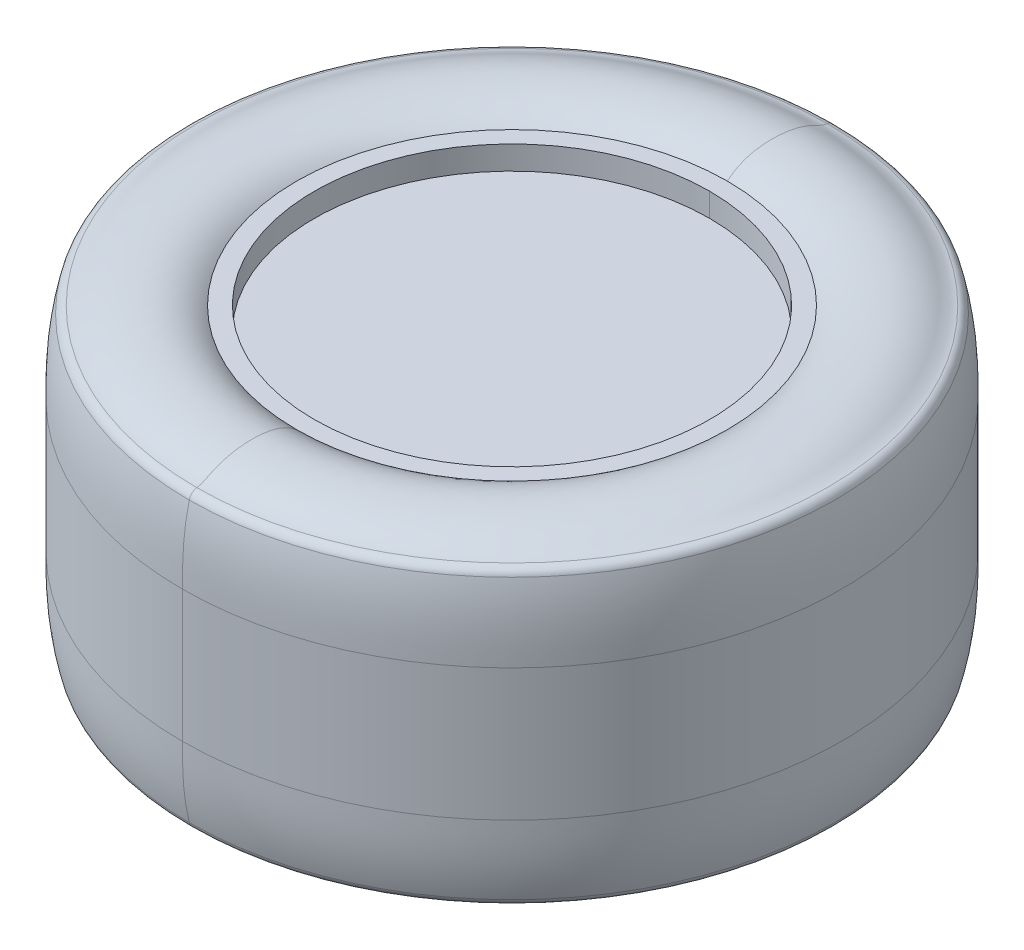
ISO-10303-21;
HEADER;
FILE_DESCRIPTION(('STEP AP214'),'2;1');
FILE_NAME('part.step','',(''),(''),'','','');
FILE_SCHEMA(('AUTOMOTIVE_DESIGN { 1 0 10303 214 1 1 1 1 }'));
ENDSEC;
DATA;
#1=APPLICATION_CONTEXT('core data for automotive mechanical design processes');
#2=APPLICATION_PROTOCOL_DEFINITION('international standard','automotive_design',2000,#1);
#3=PRODUCT_CONTEXT('',#1,'mechanical');
#4=PRODUCT('Part','Part','',(#3));
#5=PRODUCT_RELATED_PRODUCT_CATEGORY('part','',(#4));
#6=PRODUCT_DEFINITION_FORMATION('','',#4);
#7=PRODUCT_DEFINITION_CONTEXT('part definition',#1,'design');
#8=PRODUCT_DEFINITION('design','',#6,#7);
#9=PRODUCT_DEFINITION_SHAPE('','',#8);
#10=(LENGTH_UNIT() NAMED_UNIT(*) SI_UNIT(.MILLI.,.METRE.));
#11=(NAMED_UNIT(*) PLANE_ANGLE_UNIT() SI_UNIT($,.RADIAN.));
#12=(NAMED_UNIT(*) SI_UNIT($,.STERADIAN.) SOLID_ANGLE_UNIT());
#13=UNCERTAINTY_MEASURE_WITH_UNIT(LENGTH_MEASURE(1.E-05),#10,'distance_accuracy_value','');
#14=(GEOMETRIC_REPRESENTATION_CONTEXT(3) GLOBAL_UNCERTAINTY_ASSIGNED_CONTEXT((#13)) GLOBAL_UNIT_ASSIGNED_CONTEXT((#10,
#11,#12)) REPRESENTATION_CONTEXT('',''));
#15=CARTESIAN_POINT('',(0.,0.,0.));
#16=DIRECTION('',(0.,0.,1.));
#17=DIRECTION('',(1.,0.,0.));
#18=AXIS2_PLACEMENT_3D('',#15,#16,#17);
#19=CARTESIAN_POINT('',(3000.,-678.9999999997,71.320372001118));
#20=CARTESIAN_POINT('',(3000.,-668.463984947,58.611324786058));
#21=CARTESIAN_POINT('',(3000.,-661.736889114,36.802176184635));
#22=CARTESIAN_POINT('',(3000.,-661.4900912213,10.766149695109));
#23=CARTESIAN_POINT('',(3000.,-666.2308892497,-8.378636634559));
#24=CARTESIAN_POINT('',(3000.,-671.9334367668,-17.87878802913));
#25=CARTESIAN_POINT('',(3000.,-675.9960068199,-23.94984631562));
#26=CARTESIAN_POINT('',(3000.,-678.3635739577,-29.67599466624));
#27=CARTESIAN_POINT('',(3000.,-679.2386406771,-34.76891355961));
#28=(BOUNDED_CURVE() B_SPLINE_CURVE(7,(#19,#20,#21,#22,#23,#24,#25,#26,#27),.UNSPECIFIED.,.F.,
.F.) B_SPLINE_CURVE_WITH_KNOTS((8,1,8),(0.,0.532659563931,1.),
.UNSPECIFIED.) CURVE() GEOMETRIC_REPRESENTATION_ITEM() RATIONAL_B_SPLINE_CURVE((1.,1.,1.,1.,1.,
1.,1.,1.,1.)) REPRESENTATION_ITEM(''));
#29=CARTESIAN_POINT('',(3000.,-678.9999999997,300.));
#30=DIRECTION('',(0.,-1.,0.));
#31=AXIS1_PLACEMENT('',#29,#30);
#32=SURFACE_OF_REVOLUTION('',#28,#31);
#33=CARTESIAN_POINT('',(3000.,-678.9999999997,71.320372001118));
#34=CARTESIAN_POINT('',(3000.,-668.463984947,58.611324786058));
#35=CARTESIAN_POINT('',(3000.,-661.736889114,36.802176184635));
#36=CARTESIAN_POINT('',(3000.,-661.4900912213,10.766149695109));
#37=CARTESIAN_POINT('',(3000.,-666.2308892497,-8.37863663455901));
#38=CARTESIAN_POINT('',(3000.,-671.9334367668,-17.87878802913));
#39=CARTESIAN_POINT('',(3000.,-675.9960068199,-23.94984631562));
#40=CARTESIAN_POINT('',(3000.,-678.3635739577,-29.67599466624));
#41=CARTESIAN_POINT('',(3000.,-679.2386406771,-34.76891355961));
#42=(BOUNDED_CURVE() B_SPLINE_CURVE(7,(#33,#34,#35,#36,#37,#38,#39,#40,#41),.UNSPECIFIED.,.F.,
.F.) B_SPLINE_CURVE_WITH_KNOTS((8,1,8),(0.,0.532659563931,1.),
.UNSPECIFIED.) CURVE() GEOMETRIC_REPRESENTATION_ITEM() RATIONAL_B_SPLINE_CURVE((1.,1.,1.,1.,1.,
1.,1.,1.,1.)) REPRESENTATION_ITEM(''));
#43=CARTESIAN_POINT('',(3000.,-678.9999999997,71.32037200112));
#44=VERTEX_POINT('',#43);
#45=CARTESIAN_POINT('',(3000.,-679.2386406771,-34.76891355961));
#46=VERTEX_POINT('',#45);
#47=EDGE_CURVE('E206',#44,#46,#42,.T.);
#48=ORIENTED_EDGE('',*,*,#47,.F.);
#49=CARTESIAN_POINT('',(3000.,-678.9999999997,300.));
#50=DIRECTION('',(0.,1.,0.));
#51=DIRECTION('',(0.,0.,-1.));
#52=AXIS2_PLACEMENT_3D('',#49,#50,#51);
#53=CIRCLE('',#52,228.67962799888);
#54=CARTESIAN_POINT('',(3000.,-678.9999999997,528.679627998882));
#55=VERTEX_POINT('',#54);
#56=EDGE_CURVE('E41',#55,#44,#53,.T.);
#57=ORIENTED_EDGE('',*,*,#56,.F.);
#58=CARTESIAN_POINT('',(3000.,-678.9999999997,528.679627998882));
#59=CARTESIAN_POINT('',(3000.,-668.463984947,541.388675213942));
#60=CARTESIAN_POINT('',(3000.,-661.736889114,563.197823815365));
#61=CARTESIAN_POINT('',(3000.,-661.4900912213,589.233850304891));
#62=CARTESIAN_POINT('',(3000.,-666.2308892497,608.378636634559));
#63=CARTESIAN_POINT('',(3000.,-671.9334367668,617.87878802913));
#64=CARTESIAN_POINT('',(3000.,-675.9960068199,623.94984631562));
#65=CARTESIAN_POINT('',(3000.,-678.3635739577,629.67599466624));
#66=CARTESIAN_POINT('',(3000.,-679.2386406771,634.76891355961));
#67=(BOUNDED_CURVE() B_SPLINE_CURVE(7,(#58,#59,#60,#61,#62,#63,#64,#65,#66),.UNSPECIFIED.,.F.,
.F.) B_SPLINE_CURVE_WITH_KNOTS((8,1,8),(0.,0.532659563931,1.),
.UNSPECIFIED.) CURVE() GEOMETRIC_REPRESENTATION_ITEM() RATIONAL_B_SPLINE_CURVE((1.,1.,1.,1.,1.,
1.,1.,1.,1.)) REPRESENTATION_ITEM(''));
#68=CARTESIAN_POINT('',(3000.,-679.2386406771,634.76891355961));
#69=VERTEX_POINT('',#68);
#70=EDGE_CURVE('E11',#55,#69,#67,.T.);
#71=ORIENTED_EDGE('',*,*,#70,.T.);
#72=CARTESIAN_POINT('',(3000.,-679.2386406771,300.));
#73=DIRECTION('',(0.,1.,0.));
#74=DIRECTION('',(0.,0.,-1.));
#75=AXIS2_PLACEMENT_3D('',#72,#73,#74);
#76=CIRCLE('',#75,334.76891355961);
#77=EDGE_CURVE('E29',#69,#46,#76,.T.);
#78=ORIENTED_EDGE('',*,*,#77,.T.);
#79=EDGE_LOOP('',(#48,#57,#71,#78));
#80=FACE_BOUND('',#79,.T.);
#81=ADVANCED_FACE('F16',(#80),#32,.T.);
#82=CARTESIAN_POINT('',(3000.,-686.7224839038,-42.79019819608));
#83=CARTESIAN_POINT('',(3000.,-716.2539641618,-50.));
#84=CARTESIAN_POINT('',(3000.,-740.6190547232,-50.));
#85=CARTESIAN_POINT('',(3000.,-765.,-50.));
#86=(BOUNDED_CURVE() B_SPLINE_CURVE(3,(#82,#83,#84,#85),.UNSPECIFIED.,.F.,
.F.) B_SPLINE_CURVE_WITH_KNOTS((4,4),(0.,1.),
.UNSPECIFIED.) CURVE() GEOMETRIC_REPRESENTATION_ITEM() RATIONAL_B_SPLINE_CURVE((1.,1.,1.,1.)) REPRESENTATION_ITEM(''));
#87=CARTESIAN_POINT('',(3000.,-686.7224839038,300.));
#88=DIRECTION('',(0.,-1.,0.));
#89=AXIS1_PLACEMENT('',#87,#88);
#90=SURFACE_OF_REVOLUTION('',#86,#89);
#91=CARTESIAN_POINT('',(3000.,-686.7224839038,-42.79019819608));
#92=CARTESIAN_POINT('',(3000.,-716.2539641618,-50.));
#93=CARTESIAN_POINT('',(3000.,-740.6190547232,-50.));
#94=CARTESIAN_POINT('',(3000.,-765.,-50.));
#95=(BOUNDED_CURVE() B_SPLINE_CURVE(3,(#91,#92,#93,#94),.UNSPECIFIED.,.F.,
.F.) B_SPLINE_CURVE_WITH_KNOTS((4,4),(0.,1.),
.UNSPECIFIED.) CURVE() GEOMETRIC_REPRESENTATION_ITEM() RATIONAL_B_SPLINE_CURVE((1.,1.,1.,1.)) REPRESENTATION_ITEM(''));
#96=CARTESIAN_POINT('',(3000.,-686.722483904,-42.79019819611));
#97=VERTEX_POINT('',#96);
#98=CARTESIAN_POINT('',(3000.,-765.,-50.));
#99=VERTEX_POINT('',#98);
#100=EDGE_CURVE('E216',#97,#99,#95,.T.);
#101=ORIENTED_EDGE('',*,*,#100,.F.);
#102=CARTESIAN_POINT('',(3000.,-686.722483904,300.));
#103=DIRECTION('',(0.,1.,0.));
#104=DIRECTION('',(0.,0.,-1.));
#105=AXIS2_PLACEMENT_3D('',#102,#103,#104);
#106=CIRCLE('',#105,342.79019819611);
#107=CARTESIAN_POINT('',(3000.,-686.722483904,642.79019819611));
#108=VERTEX_POINT('',#107);
#109=EDGE_CURVE('E188',#108,#97,#106,.T.);
#110=ORIENTED_EDGE('',*,*,#109,.F.);
#111=CARTESIAN_POINT('',(3000.,-686.7224839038,642.79019819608));
#112=CARTESIAN_POINT('',(3000.,-716.2539641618,650.));
#113=CARTESIAN_POINT('',(3000.,-740.6190547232,650.));
#114=CARTESIAN_POINT('',(3000.,-765.,650.));
#115=(BOUNDED_CURVE() B_SPLINE_CURVE(3,(#111,#112,#113,#114),.UNSPECIFIED.,.F.,
.F.) B_SPLINE_CURVE_WITH_KNOTS((4,4),(0.,1.),
.UNSPECIFIED.) CURVE() GEOMETRIC_REPRESENTATION_ITEM() RATIONAL_B_SPLINE_CURVE((1.,1.,1.,1.)) REPRESENTATION_ITEM(''));
#116=CARTESIAN_POINT('',(3000.,-765.,650.));
#117=VERTEX_POINT('',#116);
#118=EDGE_CURVE('E357',#108,#117,#115,.T.);
#119=ORIENTED_EDGE('',*,*,#118,.T.);
#120=CARTESIAN_POINT('',(3000.,-765.,300.));
#121=DIRECTION('',(0.,1.,0.));
#122=DIRECTION('',(0.,0.,-1.));
#123=AXIS2_PLACEMENT_3D('',#120,#121,#122);
#124=CIRCLE('',#123,350.);
#125=EDGE_CURVE('E183',#117,#99,#124,.T.);
#126=ORIENTED_EDGE('',*,*,#125,.T.);
#127=EDGE_LOOP('',(#101,#110,#119,#126));
#128=FACE_BOUND('',#127,.T.);
#129=ADVANCED_FACE('F282',(#128),#90,.T.);
#130=CARTESIAN_POINT('',(3000.,-991.0000000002,71.320372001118));
#131=CARTESIAN_POINT('',(3000.,-1001.536015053,58.611324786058));
#132=CARTESIAN_POINT('',(3000.,-1008.263110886,36.802176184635));
#133=CARTESIAN_POINT('',(3000.,-1008.509908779,10.766149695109));
#134=CARTESIAN_POINT('',(3000.,-1003.76911075,-8.378636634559));
#135=CARTESIAN_POINT('',(3000.,-998.0665632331,-17.87878802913));
#136=CARTESIAN_POINT('',(3000.,-994.00399318,-23.94984631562));
#137=CARTESIAN_POINT('',(3000.,-991.6364260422,-29.67599466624));
#138=CARTESIAN_POINT('',(3000.,-990.7613593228,-34.76891355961));
#139=(BOUNDED_CURVE() B_SPLINE_CURVE(7,(#130,#131,#132,#133,#134,#135,#136,#137,#138),
.UNSPECIFIED.,.F.,.F.) B_SPLINE_CURVE_WITH_KNOTS((8,1,8),(0.,0.532659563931,1.),
.UNSPECIFIED.) CURVE() GEOMETRIC_REPRESENTATION_ITEM() RATIONAL_B_SPLINE_CURVE((1.,1.,1.,1.,1.,
1.,1.,1.,1.)) REPRESENTATION_ITEM(''));
#140=CARTESIAN_POINT('',(3000.,-991.0000000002,300.));
#141=DIRECTION('',(0.,1.,0.));
#142=AXIS1_PLACEMENT('',#140,#141);
#143=SURFACE_OF_REVOLUTION('',#139,#142);
#144=CARTESIAN_POINT('',(3000.,-991.0000000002,71.320372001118));
#145=CARTESIAN_POINT('',(3000.,-1001.536015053,58.611324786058));
#146=CARTESIAN_POINT('',(3000.,-1008.263110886,36.802176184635));
#147=CARTESIAN_POINT('',(3000.,-1008.509908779,10.766149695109));
#148=CARTESIAN_POINT('',(3000.,-1003.76911075,-8.37863663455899));
#149=CARTESIAN_POINT('',(3000.,-998.0665632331,-17.87878802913));
#150=CARTESIAN_POINT('',(3000.,-994.00399318,-23.94984631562));
#151=CARTESIAN_POINT('',(3000.,-991.6364260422,-29.67599466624));
#152=CARTESIAN_POINT('',(3000.,-990.7613593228,-34.76891355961));
#153=(BOUNDED_CURVE() B_SPLINE_CURVE(7,(#144,#145,#146,#147,#148,#149,#150,#151,#152),
.UNSPECIFIED.,.F.,.F.) B_SPLINE_CURVE_WITH_KNOTS((8,1,8),(0.,0.532659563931,1.),
.UNSPECIFIED.) CURVE() GEOMETRIC_REPRESENTATION_ITEM() RATIONAL_B_SPLINE_CURVE((1.,1.,1.,1.,1.,
1.,1.,1.,1.)) REPRESENTATION_ITEM(''));
#154=CARTESIAN_POINT('',(3000.,-991.0000000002,71.32037200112));
#155=VERTEX_POINT('',#154);
#156=CARTESIAN_POINT('',(3000.,-990.7613593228,-34.76891355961));
#157=VERTEX_POINT('',#156);
#158=EDGE_CURVE('E389',#155,#157,#153,.T.);
#159=ORIENTED_EDGE('',*,*,#158,.F.);
#160=CARTESIAN_POINT('',(3000.,-991.0000000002,300.));
#161=DIRECTION('',(0.,-1.,0.));
#162=DIRECTION('',(0.,0.,-1.));
#163=AXIS2_PLACEMENT_3D('',#160,#161,#162);
#164=CIRCLE('',#163,228.67962799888);
#165=CARTESIAN_POINT('',(3000.,-991.0000000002,528.679627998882));
#166=VERTEX_POINT('',#165);
#167=EDGE_CURVE('E395',#166,#155,#164,.T.);
#168=ORIENTED_EDGE('',*,*,#167,.F.);
#169=CARTESIAN_POINT('',(3000.,-991.0000000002,528.679627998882));
#170=CARTESIAN_POINT('',(3000.,-1001.536015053,541.388675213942));
#171=CARTESIAN_POINT('',(3000.,-1008.263110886,563.197823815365));
#172=CARTESIAN_POINT('',(3000.,-1008.509908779,589.233850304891));
#173=CARTESIAN_POINT('',(3000.,-1003.76911075,608.378636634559));
#174=CARTESIAN_POINT('',(3000.,-998.0665632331,617.87878802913));
#175=CARTESIAN_POINT('',(3000.,-994.00399318,623.94984631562));
#176=CARTESIAN_POINT('',(3000.,-991.6364260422,629.67599466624));
#177=CARTESIAN_POINT('',(3000.,-990.7613593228,634.76891355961));
#178=(BOUNDED_CURVE() B_SPLINE_CURVE(7,(#169,#170,#171,#172,#173,#174,#175,#176,#177),
.UNSPECIFIED.,.F.,.F.) B_SPLINE_CURVE_WITH_KNOTS((8,1,8),(0.,0.532659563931,1.),
.UNSPECIFIED.) CURVE() GEOMETRIC_REPRESENTATION_ITEM() RATIONAL_B_SPLINE_CURVE((1.,1.,1.,1.,1.,
1.,1.,1.,1.)) REPRESENTATION_ITEM(''));
#179=CARTESIAN_POINT('',(3000.,-990.7613593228,634.76891355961));
#180=VERTEX_POINT('',#179);
#181=EDGE_CURVE('E231',#166,#180,#178,.T.);
#182=ORIENTED_EDGE('',*,*,#181,.T.);
#183=CARTESIAN_POINT('',(3000.,-990.7613593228,300.));
#184=DIRECTION('',(0.,-1.,0.));
#185=DIRECTION('',(0.,0.,-1.));
#186=AXIS2_PLACEMENT_3D('',#183,#184,#185);
#187=CIRCLE('',#186,334.76891355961);
#188=EDGE_CURVE('E224',#180,#157,#187,.T.);
#189=ORIENTED_EDGE('',*,*,#188,.T.);
#190=EDGE_LOOP('',(#159,#168,#182,#189));
#191=FACE_BOUND('',#190,.T.);
#192=ADVANCED_FACE('F288',(#191),#143,.T.);
#193=CARTESIAN_POINT('',(3000.,-983.2775160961,-42.79019819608));
#194=CARTESIAN_POINT('',(3000.,-953.7460358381,-50.));
#195=CARTESIAN_POINT('',(3000.,-929.3809452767,-50.));
#196=CARTESIAN_POINT('',(3000.,-905.,-50.));
#197=(BOUNDED_CURVE() B_SPLINE_CURVE(3,(#193,#194,#195,#196),.UNSPECIFIED.,.F.,
.F.) B_SPLINE_CURVE_WITH_KNOTS((4,4),(0.,1.),
.UNSPECIFIED.) CURVE() GEOMETRIC_REPRESENTATION_ITEM() RATIONAL_B_SPLINE_CURVE((1.,1.,1.,1.)) REPRESENTATION_ITEM(''));
#198=CARTESIAN_POINT('',(3000.,-983.2775160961,300.));
#199=DIRECTION('',(0.,1.,0.));
#200=AXIS1_PLACEMENT('',#198,#199);
#201=SURFACE_OF_REVOLUTION('',#197,#200);
#202=CARTESIAN_POINT('',(3000.,-983.2775160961,-42.79019819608));
#203=CARTESIAN_POINT('',(3000.,-953.7460358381,-50.));
#204=CARTESIAN_POINT('',(3000.,-929.3809452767,-50.));
#205=CARTESIAN_POINT('',(3000.,-905.,-50.));
#206=(BOUNDED_CURVE() B_SPLINE_CURVE(3,(#202,#203,#204,#205),.UNSPECIFIED.,.F.,
.F.) B_SPLINE_CURVE_WITH_KNOTS((4,4),(0.,1.),
.UNSPECIFIED.) CURVE() GEOMETRIC_REPRESENTATION_ITEM() RATIONAL_B_SPLINE_CURVE((1.,1.,1.,1.)) REPRESENTATION_ITEM(''));
#207=CARTESIAN_POINT('',(3000.,-983.2775160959,-42.79019819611));
#208=VERTEX_POINT('',#207);
#209=CARTESIAN_POINT('',(3000.,-905.,-50.));
#210=VERTEX_POINT('',#209);
#211=EDGE_CURVE('E193',#208,#210,#206,.T.);
#212=ORIENTED_EDGE('',*,*,#211,.F.);
#213=CARTESIAN_POINT('',(3000.,-983.2775160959,300.));
#214=DIRECTION('',(0.,-1.,0.));
#215=DIRECTION('',(0.,0.,-1.));
#216=AXIS2_PLACEMENT_3D('',#213,#214,#215);
#217=CIRCLE('',#216,342.79019819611);
#218=CARTESIAN_POINT('',(3000.,-983.2775160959,642.79019819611));
#219=VERTEX_POINT('',#218);
#220=EDGE_CURVE('E171',#219,#208,#217,.T.);
#221=ORIENTED_EDGE('',*,*,#220,.F.);
#222=CARTESIAN_POINT('',(3000.,-983.2775160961,642.79019819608));
#223=CARTESIAN_POINT('',(3000.,-953.7460358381,650.));
#224=CARTESIAN_POINT('',(3000.,-929.3809452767,650.));
#225=CARTESIAN_POINT('',(3000.,-905.,650.));
#226=(BOUNDED_CURVE() B_SPLINE_CURVE(3,(#222,#223,#224,#225),.UNSPECIFIED.,.F.,
.F.) B_SPLINE_CURVE_WITH_KNOTS((4,4),(0.,1.),
.UNSPECIFIED.) CURVE() GEOMETRIC_REPRESENTATION_ITEM() RATIONAL_B_SPLINE_CURVE((1.,1.,1.,1.)) REPRESENTATION_ITEM(''));
#227=CARTESIAN_POINT('',(3000.,-905.,650.));
#228=VERTEX_POINT('',#227);
#229=EDGE_CURVE('E232',#219,#228,#226,.T.);
#230=ORIENTED_EDGE('',*,*,#229,.T.);
#231=CARTESIAN_POINT('',(3000.,-905.,300.));
#232=DIRECTION('',(0.,-1.,0.));
#233=DIRECTION('',(0.,0.,-1.));
#234=AXIS2_PLACEMENT_3D('',#231,#232,#233);
#235=CIRCLE('',#234,350.);
#236=EDGE_CURVE('E236',#228,#210,#235,.T.);
#237=ORIENTED_EDGE('',*,*,#236,.T.);
#238=EDGE_LOOP('',(#212,#221,#230,#237));
#239=FACE_BOUND('',#238,.T.);
#240=ADVANCED_FACE('F292',(#239),#201,.T.);
#241=CARTESIAN_POINT('',(3000.,-743.6418141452,300.));
#242=DIRECTION('',(0.,-1.,0.));
#243=DIRECTION('',(0.,0.,1.));
#244=AXIS2_PLACEMENT_3D('',#241,#242,#243);
#245=CYLINDRICAL_SURFACE('',#244,210.);
#246=DIRECTION('',(0.,-1.,0.));
#247=VECTOR('',#246,1.);
#248=CARTESIAN_POINT('',(3000.,-691.49999999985,510.));
#249=LINE('',#248,#247);
#250=CARTESIAN_POINT('',(3000.,-678.9999999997,510.));
#251=VERTEX_POINT('',#250);
#252=CARTESIAN_POINT('',(3000.,-704.,510.));
#253=VERTEX_POINT('',#252);
#254=EDGE_CURVE('E149',#251,#253,#249,.T.);
#255=ORIENTED_EDGE('',*,*,#254,.F.);
#256=CARTESIAN_POINT('',(3000.,-678.9999999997,300.));
#257=DIRECTION('',(0.,1.,0.));
#258=DIRECTION('',(0.,0.,-1.));
#259=AXIS2_PLACEMENT_3D('',#256,#257,#258);
#260=CIRCLE('',#259,210.);
#261=CARTESIAN_POINT('',(3000.,-678.9999999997,90.));
#262=VERTEX_POINT('',#261);
#263=EDGE_CURVE('E233',#251,#262,#260,.T.);
#264=ORIENTED_EDGE('',*,*,#263,.T.);
#265=DIRECTION('',(0.,1.,0.));
#266=VECTOR('',#265,1.);
#267=CARTESIAN_POINT('',(3000.,-691.49999999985,90.));
#268=LINE('',#267,#266);
#269=CARTESIAN_POINT('',(3000.,-704.,90.));
#270=VERTEX_POINT('',#269);
#271=EDGE_CURVE('E160',#270,#262,#268,.T.);
#272=ORIENTED_EDGE('',*,*,#271,.F.);
#273=CARTESIAN_POINT('',(3000.,-704.,300.));
#274=DIRECTION('',(0.,1.,0.));
#275=DIRECTION('',(0.,0.,-1.));
#276=AXIS2_PLACEMENT_3D('',#273,#274,#275);
#277=CIRCLE('',#276,210.);
#278=EDGE_CURVE('E163',#253,#270,#277,.T.);
#279=ORIENTED_EDGE('',*,*,#278,.F.);
#280=EDGE_LOOP('',(#255,#264,#272,#279));
#281=FACE_BOUND('',#280,.T.);
#282=ADVANCED_FACE('F164',(#281),#245,.F.);
#283=CARTESIAN_POINT('',(3000.,-689.0942196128,300.));
#284=DIRECTION('',(0.,1.,0.));
#285=DIRECTION('',(0.,0.,1.));
#286=AXIS2_PLACEMENT_3D('',#283,#284,#285);
#287=TOROIDAL_SURFACE('',#286,333.07552528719,10.);
#288=CARTESIAN_POINT('',(3000.,-689.0942196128,633.07552528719));
#289=DIRECTION('',(-1.,0.,0.));
#290=DIRECTION('',(0.,0.,1.));
#291=AXIS2_PLACEMENT_3D('',#288,#289,#290);
#292=CIRCLE('',#291,10.);
#293=EDGE_CURVE('E240',#108,#69,#292,.T.);
#294=ORIENTED_EDGE('',*,*,#293,.F.);
#295=ORIENTED_EDGE('',*,*,#109,.T.);
#296=CARTESIAN_POINT('',(3000.,-689.0942196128,-33.07552528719));
#297=DIRECTION('',(-1.,0.,0.));
#298=DIRECTION('',(0.,0.,-1.));
#299=AXIS2_PLACEMENT_3D('',#296,#297,#298);
#300=CIRCLE('',#299,10.);
#301=EDGE_CURVE('E205',#46,#97,#300,.T.);
#302=ORIENTED_EDGE('',*,*,#301,.F.);
#303=ORIENTED_EDGE('',*,*,#77,.F.);
#304=EDGE_LOOP('',(#294,#295,#302,#303));
#305=FACE_BOUND('',#304,.T.);
#306=ADVANCED_FACE('F506',(#305),#287,.T.);
#307=CARTESIAN_POINT('',(3000.,-926.3581858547,300.));
#308=DIRECTION('',(0.,-1.,0.));
#309=DIRECTION('',(0.,0.,1.));
#310=AXIS2_PLACEMENT_3D('',#307,#308,#309);
#311=CONICAL_SURFACE('',#310,193.50933335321,0.872664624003);
#312=DIRECTION('',(0.,0.642787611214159,-0.766044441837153));
#313=VECTOR('',#312,1.);
#314=CARTESIAN_POINT('',(3000.,-926.3581858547,493.50933335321));
#315=LINE('',#314,#313);
#316=CARTESIAN_POINT('',(3000.,-936.,505.));
#317=VERTEX_POINT('',#316);
#318=CARTESIAN_POINT('',(3000.,-926.3581858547,493.50933335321));
#319=VERTEX_POINT('',#318);
#320=EDGE_CURVE('E211',#317,#319,#315,.T.);
#321=ORIENTED_EDGE('',*,*,#320,.F.);
#322=CARTESIAN_POINT('',(3000.,-936.,300.));
#323=DIRECTION('',(0.,-1.,0.));
#324=DIRECTION('',(0.,0.,-1.));
#325=AXIS2_PLACEMENT_3D('',#322,#323,#324);
#326=CIRCLE('',#325,205.);
#327=CARTESIAN_POINT('',(3000.,-936.,95.));
#328=VERTEX_POINT('',#327);
#329=EDGE_CURVE('E185',#317,#328,#326,.T.);
#330=ORIENTED_EDGE('',*,*,#329,.T.);
#331=DIRECTION('',(0.,-0.642787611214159,-0.766044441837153));
#332=VECTOR('',#331,1.);
#333=CARTESIAN_POINT('',(3000.,-926.3581858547,106.49066664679));
#334=LINE('',#333,#332);
#335=CARTESIAN_POINT('',(3000.,-926.3581858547,106.49066664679));
#336=VERTEX_POINT('',#335);
#337=EDGE_CURVE('E199',#336,#328,#334,.T.);
#338=ORIENTED_EDGE('',*,*,#337,.F.);
#339=CARTESIAN_POINT('',(3000.,-926.3581858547,300.));
#340=DIRECTION('',(0.,-1.,0.));
#341=DIRECTION('',(0.,0.,-1.));
#342=AXIS2_PLACEMENT_3D('',#339,#340,#341);
#343=CIRCLE('',#342,193.50933335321);
#344=EDGE_CURVE('E222',#319,#336,#343,.T.);
#345=ORIENTED_EDGE('',*,*,#344,.F.);
#346=EDGE_LOOP('',(#321,#330,#338,#345));
#347=FACE_BOUND('',#346,.T.);
#348=ADVANCED_FACE('F472',(#347),#311,.F.);
#349=CARTESIAN_POINT('',(3000.,-926.3581858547,300.));
#350=DIRECTION('',(0.,1.,0.));
#351=DIRECTION('',(0.,0.,1.));
#352=AXIS2_PLACEMENT_3D('',#349,#350,#351);
#353=CYLINDRICAL_SURFACE('',#352,210.);
#354=DIRECTION('',(0.,1.,0.));
#355=VECTOR('',#354,1.);
#356=CARTESIAN_POINT('',(3000.,-963.5000000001,510.));
#357=LINE('',#356,#355);
#358=CARTESIAN_POINT('',(3000.,-991.0000000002,510.));
#359=VERTEX_POINT('',#358);
#360=CARTESIAN_POINT('',(3000.,-936.,510.));
#361=VERTEX_POINT('',#360);
#362=EDGE_CURVE('E423',#359,#361,#357,.T.);
#363=ORIENTED_EDGE('',*,*,#362,.F.);
#364=CARTESIAN_POINT('',(3000.,-991.0000000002,300.));
#365=DIRECTION('',(0.,-1.,0.));
#366=DIRECTION('',(0.,0.,-1.));
#367=AXIS2_PLACEMENT_3D('',#364,#365,#366);
#368=CIRCLE('',#367,210.);
#369=CARTESIAN_POINT('',(3000.,-991.0000000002,90.));
#370=VERTEX_POINT('',#369);
#371=EDGE_CURVE('E179',#359,#370,#368,.T.);
#372=ORIENTED_EDGE('',*,*,#371,.T.);
#373=DIRECTION('',(0.,-1.,0.));
#374=VECTOR('',#373,1.);
#375=CARTESIAN_POINT('',(3000.,-963.5000000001,90.));
#376=LINE('',#375,#374);
#377=CARTESIAN_POINT('',(3000.,-936.,90.));
#378=VERTEX_POINT('',#377);
#379=EDGE_CURVE('E400',#378,#370,#376,.T.);
#380=ORIENTED_EDGE('',*,*,#379,.F.);
#381=CARTESIAN_POINT('',(3000.,-936.,300.));
#382=DIRECTION('',(0.,-1.,0.));
#383=DIRECTION('',(0.,0.,-1.));
#384=AXIS2_PLACEMENT_3D('',#381,#382,#383);
#385=CIRCLE('',#384,210.);
#386=EDGE_CURVE('E215',#361,#378,#385,.T.);
#387=ORIENTED_EDGE('',*,*,#386,.F.);
#388=EDGE_LOOP('',(#363,#372,#380,#387));
#389=FACE_BOUND('',#388,.T.);
#390=ADVANCED_FACE('F491',(#389),#353,.F.);
#391=CARTESIAN_POINT('',(3000.,-980.9057803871,300.));
#392=DIRECTION('',(0.,-1.,0.));
#393=DIRECTION('',(0.,0.,1.));
#394=AXIS2_PLACEMENT_3D('',#391,#392,#393);
#395=TOROIDAL_SURFACE('',#394,333.07552528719,10.);
#396=CARTESIAN_POINT('',(3000.,-980.9057803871,633.07552528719));
#397=DIRECTION('',(1.,0.,0.));
#398=DIRECTION('',(0.,0.,1.));
#399=AXIS2_PLACEMENT_3D('',#396,#397,#398);
#400=CIRCLE('',#399,10.);
#401=EDGE_CURVE('E194',#219,#180,#400,.T.);
#402=ORIENTED_EDGE('',*,*,#401,.F.);
#403=ORIENTED_EDGE('',*,*,#220,.T.);
#404=CARTESIAN_POINT('',(3000.,-980.9057803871,-33.07552528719));
#405=DIRECTION('',(1.,0.,0.));
#406=DIRECTION('',(0.,0.,-1.));
#407=AXIS2_PLACEMENT_3D('',#404,#405,#406);
#408=CIRCLE('',#407,10.);
#409=EDGE_CURVE('E388',#157,#208,#408,.T.);
#410=ORIENTED_EDGE('',*,*,#409,.F.);
#411=ORIENTED_EDGE('',*,*,#188,.F.);
#412=EDGE_LOOP('',(#402,#403,#410,#411));
#413=FACE_BOUND('',#412,.T.);
#414=ADVANCED_FACE('F494',(#413),#395,.T.);
#415=CARTESIAN_POINT('',(3000.,-926.3581858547,300.));
#416=DIRECTION('',(0.,1.,0.));
#417=DIRECTION('',(0.,0.,1.));
#418=AXIS2_PLACEMENT_3D('',#415,#416,#417);
#419=CYLINDRICAL_SURFACE('',#418,350.);
#420=DIRECTION('',(0.,-1.,0.));
#421=VECTOR('',#420,1.);
#422=CARTESIAN_POINT('',(3000.,-835.,650.));
#423=LINE('',#422,#421);
#424=EDGE_CURVE('E167',#117,#228,#423,.T.);
#425=ORIENTED_EDGE('',*,*,#424,.F.);
#426=CARTESIAN_POINT('',(3000.,-765.,300.));
#427=DIRECTION('',(0.,1.,0.));
#428=DIRECTION('',(0.,0.,-1.));
#429=AXIS2_PLACEMENT_3D('',#426,#427,#428);
#430=CIRCLE('',#429,350.);
#431=EDGE_CURVE('E223',#99,#117,#430,.T.);
#432=ORIENTED_EDGE('',*,*,#431,.F.);
#433=DIRECTION('',(0.,1.,0.));
#434=VECTOR('',#433,1.);
#435=CARTESIAN_POINT('',(3000.,-835.,-50.));
#436=LINE('',#435,#434);
#437=EDGE_CURVE('E207',#210,#99,#436,.T.);
#438=ORIENTED_EDGE('',*,*,#437,.F.);
#439=ORIENTED_EDGE('',*,*,#236,.F.);
#440=EDGE_LOOP('',(#425,#432,#438,#439));
#441=FACE_BOUND('',#440,.T.);
#442=ADVANCED_FACE('F364',(#441),#419,.T.);
#443=CARTESIAN_POINT('',(3000.,-704.,300.));
#444=DIRECTION('',(0.,-1.,0.));
#445=DIRECTION('',(0.,0.,-1.));
#446=AXIS2_PLACEMENT_3D('',#443,#444,#445);
#447=PLANE('',#446);
#448=CARTESIAN_POINT('',(3000.,-704.,300.));
#449=DIRECTION('',(0.,1.,0.));
#450=DIRECTION('',(0.,0.,-1.));
#451=AXIS2_PLACEMENT_3D('',#448,#449,#450);
#452=CIRCLE('',#451,210.);
#453=EDGE_CURVE('E153',#270,#253,#452,.T.);
#454=ORIENTED_EDGE('',*,*,#453,.T.);
#455=ORIENTED_EDGE('',*,*,#278,.T.);
#456=EDGE_LOOP('',(#454,#455));
#457=FACE_BOUND('',#456,.T.);
#458=ADVANCED_FACE('F169',(#457),#447,.F.);
#459=CARTESIAN_POINT('',(3000.,-926.3581858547,300.));
#460=DIRECTION('',(0.,1.,0.));
#461=DIRECTION('',(0.,0.,1.));
#462=AXIS2_PLACEMENT_3D('',#459,#460,#461);
#463=CYLINDRICAL_SURFACE('',#462,350.);
#464=ORIENTED_EDGE('',*,*,#424,.T.);
#465=CARTESIAN_POINT('',(3000.,-905.,300.));
#466=DIRECTION('',(0.,-1.,0.));
#467=DIRECTION('',(0.,0.,-1.));
#468=AXIS2_PLACEMENT_3D('',#465,#466,#467);
#469=CIRCLE('',#468,350.);
#470=EDGE_CURVE('E189',#210,#228,#469,.T.);
#471=ORIENTED_EDGE('',*,*,#470,.F.);
#472=ORIENTED_EDGE('',*,*,#437,.T.);
#473=ORIENTED_EDGE('',*,*,#125,.F.);
#474=EDGE_LOOP('',(#464,#471,#472,#473));
#475=FACE_BOUND('',#474,.T.);
#476=ADVANCED_FACE('F323',(#475),#463,.T.);
#477=CARTESIAN_POINT('',(3000.,-983.2775160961,-42.79019819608));
#478=CARTESIAN_POINT('',(3000.,-953.7460358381,-50.));
#479=CARTESIAN_POINT('',(3000.,-929.3809452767,-50.));
#480=CARTESIAN_POINT('',(3000.,-905.,-50.));
#481=(BOUNDED_CURVE() B_SPLINE_CURVE(3,(#477,#478,#479,#480),.UNSPECIFIED.,.F.,
.F.) B_SPLINE_CURVE_WITH_KNOTS((4,4),(0.,1.),
.UNSPECIFIED.) CURVE() GEOMETRIC_REPRESENTATION_ITEM() RATIONAL_B_SPLINE_CURVE((1.,1.,1.,1.)) REPRESENTATION_ITEM(''));
#482=CARTESIAN_POINT('',(3000.,-983.2775160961,300.));
#483=DIRECTION('',(0.,1.,0.));
#484=AXIS1_PLACEMENT('',#482,#483);
#485=SURFACE_OF_REVOLUTION('',#481,#484);
#486=ORIENTED_EDGE('',*,*,#211,.T.);
#487=ORIENTED_EDGE('',*,*,#470,.T.);
#488=ORIENTED_EDGE('',*,*,#229,.F.);
#489=CARTESIAN_POINT('',(3000.,-983.2775160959,300.));
#490=DIRECTION('',(0.,-1.,0.));
#491=DIRECTION('',(0.,0.,-1.));
#492=AXIS2_PLACEMENT_3D('',#489,#490,#491);
#493=CIRCLE('',#492,342.79019819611);
#494=EDGE_CURVE('E374',#208,#219,#493,.T.);
#495=ORIENTED_EDGE('',*,*,#494,.F.);
#496=EDGE_LOOP('',(#486,#487,#488,#495));
#497=FACE_BOUND('',#496,.T.);
#498=ADVANCED_FACE('F319',(#497),#485,.T.);
#499=CARTESIAN_POINT('',(3000.,-980.9057803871,300.));
#500=DIRECTION('',(0.,-1.,0.));
#501=DIRECTION('',(0.,0.,1.));
#502=AXIS2_PLACEMENT_3D('',#499,#500,#501);
#503=TOROIDAL_SURFACE('',#502,333.07552528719,10.);
#504=ORIENTED_EDGE('',*,*,#401,.T.);
#505=CARTESIAN_POINT('',(3000.,-990.7613593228,300.));
#506=DIRECTION('',(0.,-1.,0.));
#507=DIRECTION('',(0.,0.,-1.));
#508=AXIS2_PLACEMENT_3D('',#505,#506,#507);
#509=CIRCLE('',#508,334.76891355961);
#510=EDGE_CURVE('E394',#157,#180,#509,.T.);
#511=ORIENTED_EDGE('',*,*,#510,.F.);
#512=ORIENTED_EDGE('',*,*,#409,.T.);
#513=ORIENTED_EDGE('',*,*,#494,.T.);
#514=EDGE_LOOP('',(#504,#511,#512,#513));
#515=FACE_BOUND('',#514,.T.);
#516=ADVANCED_FACE('F322',(#515),#503,.T.);
#517=CARTESIAN_POINT('',(3000.,-991.0000000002,71.320372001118));
#518=CARTESIAN_POINT('',(3000.,-1001.536015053,58.611324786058));
#519=CARTESIAN_POINT('',(3000.,-1008.263110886,36.802176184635));
#520=CARTESIAN_POINT('',(3000.,-1008.509908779,10.766149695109));
#521=CARTESIAN_POINT('',(3000.,-1003.76911075,-8.378636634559));
#522=CARTESIAN_POINT('',(3000.,-998.0665632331,-17.87878802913));
#523=CARTESIAN_POINT('',(3000.,-994.00399318,-23.94984631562));
#524=CARTESIAN_POINT('',(3000.,-991.6364260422,-29.67599466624));
#525=CARTESIAN_POINT('',(3000.,-990.7613593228,-34.76891355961));
#526=(BOUNDED_CURVE() B_SPLINE_CURVE(7,(#517,#518,#519,#520,#521,#522,#523,#524,#525),
.UNSPECIFIED.,.F.,.F.) B_SPLINE_CURVE_WITH_KNOTS((8,1,8),(0.,0.532659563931,1.),
.UNSPECIFIED.) CURVE() GEOMETRIC_REPRESENTATION_ITEM() RATIONAL_B_SPLINE_CURVE((1.,1.,1.,1.,1.,
1.,1.,1.,1.)) REPRESENTATION_ITEM(''));
#527=CARTESIAN_POINT('',(3000.,-991.0000000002,300.));
#528=DIRECTION('',(0.,1.,0.));
#529=AXIS1_PLACEMENT('',#527,#528);
#530=SURFACE_OF_REVOLUTION('',#526,#529);
#531=ORIENTED_EDGE('',*,*,#158,.T.);
#532=ORIENTED_EDGE('',*,*,#510,.T.);
#533=ORIENTED_EDGE('',*,*,#181,.F.);
#534=CARTESIAN_POINT('',(3000.,-991.0000000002,300.));
#535=DIRECTION('',(0.,-1.,0.));
#536=DIRECTION('',(0.,0.,-1.));
#537=AXIS2_PLACEMENT_3D('',#534,#535,#536);
#538=CIRCLE('',#537,228.67962799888);
#539=EDGE_CURVE('E390',#155,#166,#538,.T.);
#540=ORIENTED_EDGE('',*,*,#539,.F.);
#541=EDGE_LOOP('',(#531,#532,#533,#540));
#542=FACE_BOUND('',#541,.T.);
#543=ADVANCED_FACE('F325',(#542),#530,.T.);
#544=CARTESIAN_POINT('',(3000.,-991.0000000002,90.));
#545=DIRECTION('',(0.,-1.,0.));
#546=DIRECTION('',(0.,0.,-1.));
#547=AXIS2_PLACEMENT_3D('',#544,#545,#546);
#548=PLANE('',#547);
#549=ORIENTED_EDGE('',*,*,#539,.T.);
#550=ORIENTED_EDGE('',*,*,#167,.T.);
#551=EDGE_LOOP('',(#549,#550));
#552=FACE_BOUND('',#551,.T.);
#553=CARTESIAN_POINT('',(3000.,-991.0000000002,300.));
#554=DIRECTION('',(0.,-1.,0.));
#555=DIRECTION('',(0.,0.,-1.));
#556=AXIS2_PLACEMENT_3D('',#553,#554,#555);
#557=CIRCLE('',#556,210.);
#558=EDGE_CURVE('E396',#370,#359,#557,.T.);
#559=ORIENTED_EDGE('',*,*,#558,.F.);
#560=ORIENTED_EDGE('',*,*,#371,.F.);
#561=EDGE_LOOP('',(#559,#560));
#562=FACE_BOUND('',#561,.T.);
#563=ADVANCED_FACE('F327',(#552,#562),#548,.T.);
#564=CARTESIAN_POINT('',(3000.,-926.3581858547,300.));
#565=DIRECTION('',(0.,1.,0.));
#566=DIRECTION('',(0.,0.,1.));
#567=AXIS2_PLACEMENT_3D('',#564,#565,#566);
#568=CYLINDRICAL_SURFACE('',#567,210.);
#569=ORIENTED_EDGE('',*,*,#362,.T.);
#570=CARTESIAN_POINT('',(3000.,-936.,300.));
#571=DIRECTION('',(0.,-1.,0.));
#572=DIRECTION('',(0.,0.,-1.));
#573=AXIS2_PLACEMENT_3D('',#570,#571,#572);
#574=CIRCLE('',#573,210.);
#575=EDGE_CURVE('E244',#378,#361,#574,.T.);
#576=ORIENTED_EDGE('',*,*,#575,.F.);
#577=ORIENTED_EDGE('',*,*,#379,.T.);
#578=ORIENTED_EDGE('',*,*,#558,.T.);
#579=EDGE_LOOP('',(#569,#576,#577,#578));
#580=FACE_BOUND('',#579,.T.);
#581=ADVANCED_FACE('F479',(#580),#568,.F.);
#582=CARTESIAN_POINT('',(3000.,-936.,95.));
#583=DIRECTION('',(0.,-1.,0.));
#584=DIRECTION('',(0.,0.,-1.));
#585=AXIS2_PLACEMENT_3D('',#582,#583,#584);
#586=PLANE('',#585);
#587=ORIENTED_EDGE('',*,*,#575,.T.);
#588=ORIENTED_EDGE('',*,*,#386,.T.);
#589=EDGE_LOOP('',(#587,#588));
#590=FACE_BOUND('',#589,.T.);
#591=CARTESIAN_POINT('',(3000.,-936.,300.));
#592=DIRECTION('',(0.,-1.,0.));
#593=DIRECTION('',(0.,0.,-1.));
#594=AXIS2_PLACEMENT_3D('',#591,#592,#593);
#595=CIRCLE('',#594,205.);
#596=EDGE_CURVE('E195',#328,#317,#595,.T.);
#597=ORIENTED_EDGE('',*,*,#596,.F.);
#598=ORIENTED_EDGE('',*,*,#329,.F.);
#599=EDGE_LOOP('',(#597,#598));
#600=FACE_BOUND('',#599,.T.);
#601=ADVANCED_FACE('F477',(#590,#600),#586,.T.);
#602=CARTESIAN_POINT('',(3000.,-926.3581858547,300.));
#603=DIRECTION('',(0.,-1.,0.));
#604=DIRECTION('',(0.,0.,1.));
#605=AXIS2_PLACEMENT_3D('',#602,#603,#604);
#606=CONICAL_SURFACE('',#605,193.50933335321,0.872664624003);
#607=ORIENTED_EDGE('',*,*,#320,.T.);
#608=CARTESIAN_POINT('',(3000.,-926.3581858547,300.));
#609=DIRECTION('',(0.,-1.,0.));
#610=DIRECTION('',(0.,0.,-1.));
#611=AXIS2_PLACEMENT_3D('',#608,#609,#610);
#612=CIRCLE('',#611,193.50933335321);
#613=EDGE_CURVE('E200',#336,#319,#612,.T.);
#614=ORIENTED_EDGE('',*,*,#613,.F.);
#615=ORIENTED_EDGE('',*,*,#337,.T.);
#616=ORIENTED_EDGE('',*,*,#596,.T.);
#617=EDGE_LOOP('',(#607,#614,#615,#616));
#618=FACE_BOUND('',#617,.T.);
#619=ADVANCED_FACE('F284',(#618),#606,.F.);
#620=CARTESIAN_POINT('',(3000.,-926.3581858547,300.));
#621=DIRECTION('',(0.,-1.,0.));
#622=DIRECTION('',(0.,0.,-1.));
#623=AXIS2_PLACEMENT_3D('',#620,#621,#622);
#624=PLANE('',#623);
#625=ORIENTED_EDGE('',*,*,#613,.T.);
#626=ORIENTED_EDGE('',*,*,#344,.T.);
#627=EDGE_LOOP('',(#625,#626));
#628=FACE_BOUND('',#627,.T.);
#629=ADVANCED_FACE('F332',(#628),#624,.T.);
#630=CARTESIAN_POINT('',(3000.,-686.7224839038,-42.79019819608));
#631=CARTESIAN_POINT('',(3000.,-716.2539641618,-50.));
#632=CARTESIAN_POINT('',(3000.,-740.6190547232,-50.));
#633=CARTESIAN_POINT('',(3000.,-765.,-50.));
#634=(BOUNDED_CURVE() B_SPLINE_CURVE(3,(#630,#631,#632,#633),.UNSPECIFIED.,.F.,
.F.) B_SPLINE_CURVE_WITH_KNOTS((4,4),(0.,1.),
.UNSPECIFIED.) CURVE() GEOMETRIC_REPRESENTATION_ITEM() RATIONAL_B_SPLINE_CURVE((1.,1.,1.,1.)) REPRESENTATION_ITEM(''));
#635=CARTESIAN_POINT('',(3000.,-686.7224839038,300.));
#636=DIRECTION('',(0.,-1.,0.));
#637=AXIS1_PLACEMENT('',#635,#636);
#638=SURFACE_OF_REVOLUTION('',#634,#637);
#639=ORIENTED_EDGE('',*,*,#100,.T.);
#640=ORIENTED_EDGE('',*,*,#431,.T.);
#641=ORIENTED_EDGE('',*,*,#118,.F.);
#642=CARTESIAN_POINT('',(3000.,-686.722483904,300.));
#643=DIRECTION('',(0.,1.,0.));
#644=DIRECTION('',(0.,0.,-1.));
#645=AXIS2_PLACEMENT_3D('',#642,#643,#644);
#646=CIRCLE('',#645,342.79019819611);
#647=EDGE_CURVE('E201',#97,#108,#646,.T.);
#648=ORIENTED_EDGE('',*,*,#647,.F.);
#649=EDGE_LOOP('',(#639,#640,#641,#648));
#650=FACE_BOUND('',#649,.T.);
#651=ADVANCED_FACE('F329',(#650),#638,.T.);
#652=CARTESIAN_POINT('',(3000.,-689.0942196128,300.));
#653=DIRECTION('',(0.,1.,0.));
#654=DIRECTION('',(0.,0.,1.));
#655=AXIS2_PLACEMENT_3D('',#652,#653,#654);
#656=TOROIDAL_SURFACE('',#655,333.07552528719,10.);
#657=ORIENTED_EDGE('',*,*,#293,.T.);
#658=CARTESIAN_POINT('',(3000.,-679.2386406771,300.));
#659=DIRECTION('',(0.,1.,0.));
#660=DIRECTION('',(0.,0.,-1.));
#661=AXIS2_PLACEMENT_3D('',#658,#659,#660);
#662=CIRCLE('',#661,334.76891355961);
#663=EDGE_CURVE('E248',#46,#69,#662,.T.);
#664=ORIENTED_EDGE('',*,*,#663,.F.);
#665=ORIENTED_EDGE('',*,*,#301,.T.);
#666=ORIENTED_EDGE('',*,*,#647,.T.);
#667=EDGE_LOOP('',(#657,#664,#665,#666));
#668=FACE_BOUND('',#667,.T.);
#669=ADVANCED_FACE('F331',(#668),#656,.T.);
#670=CARTESIAN_POINT('',(3000.,-678.9999999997,71.320372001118));
#671=CARTESIAN_POINT('',(3000.,-668.463984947,58.611324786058));
#672=CARTESIAN_POINT('',(3000.,-661.736889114,36.802176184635));
#673=CARTESIAN_POINT('',(3000.,-661.4900912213,10.766149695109));
#674=CARTESIAN_POINT('',(3000.,-666.2308892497,-8.378636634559));
#675=CARTESIAN_POINT('',(3000.,-671.9334367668,-17.87878802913));
#676=CARTESIAN_POINT('',(3000.,-675.9960068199,-23.94984631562));
#677=CARTESIAN_POINT('',(3000.,-678.3635739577,-29.67599466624));
#678=CARTESIAN_POINT('',(3000.,-679.2386406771,-34.76891355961));
#679=(BOUNDED_CURVE() B_SPLINE_CURVE(7,(#670,#671,#672,#673,#674,#675,#676,#677,#678),
.UNSPECIFIED.,.F.,.F.) B_SPLINE_CURVE_WITH_KNOTS((8,1,8),(0.,0.532659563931,1.),
.UNSPECIFIED.) CURVE() GEOMETRIC_REPRESENTATION_ITEM() RATIONAL_B_SPLINE_CURVE((1.,1.,1.,1.,1.,
1.,1.,1.,1.)) REPRESENTATION_ITEM(''));
#680=CARTESIAN_POINT('',(3000.,-678.9999999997,300.));
#681=DIRECTION('',(0.,-1.,0.));
#682=AXIS1_PLACEMENT('',#680,#681);
#683=SURFACE_OF_REVOLUTION('',#679,#682);
#684=ORIENTED_EDGE('',*,*,#47,.T.);
#685=ORIENTED_EDGE('',*,*,#663,.T.);
#686=ORIENTED_EDGE('',*,*,#70,.F.);
#687=CARTESIAN_POINT('',(3000.,-678.9999999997,300.));
#688=DIRECTION('',(0.,1.,0.));
#689=DIRECTION('',(0.,0.,-1.));
#690=AXIS2_PLACEMENT_3D('',#687,#688,#689);
#691=CIRCLE('',#690,228.67962799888);
#692=EDGE_CURVE('E252',#44,#55,#691,.T.);
#693=ORIENTED_EDGE('',*,*,#692,.F.);
#694=EDGE_LOOP('',(#684,#685,#686,#693));
#695=FACE_BOUND('',#694,.T.);
#696=ADVANCED_FACE('F18',(#695),#683,.T.);
#697=CARTESIAN_POINT('',(3000.,-678.9999999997,90.));
#698=DIRECTION('',(0.,1.,0.));
#699=DIRECTION('',(1.,0.,0.));
#700=AXIS2_PLACEMENT_3D('',#697,#698,#699);
#701=PLANE('',#700);
#702=ORIENTED_EDGE('',*,*,#692,.T.);
#703=ORIENTED_EDGE('',*,*,#56,.T.);
#704=EDGE_LOOP('',(#702,#703));
#705=FACE_BOUND('',#704,.T.);
#706=CARTESIAN_POINT('',(3000.,-678.9999999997,300.));
#707=DIRECTION('',(0.,1.,0.));
#708=DIRECTION('',(0.,0.,-1.));
#709=AXIS2_PLACEMENT_3D('',#706,#707,#708);
#710=CIRCLE('',#709,210.);
#711=EDGE_CURVE('E155',#262,#251,#710,.T.);
#712=ORIENTED_EDGE('',*,*,#711,.F.);
#713=ORIENTED_EDGE('',*,*,#263,.F.);
#714=EDGE_LOOP('',(#712,#713));
#715=FACE_BOUND('',#714,.T.);
#716=ADVANCED_FACE('F516',(#705,#715),#701,.T.);
#717=CARTESIAN_POINT('',(3000.,-743.6418141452,300.));
#718=DIRECTION('',(0.,-1.,0.));
#719=DIRECTION('',(0.,0.,1.));
#720=AXIS2_PLACEMENT_3D('',#717,#718,#719);
#721=CYLINDRICAL_SURFACE('',#720,210.);
#722=ORIENTED_EDGE('',*,*,#254,.T.);
#723=ORIENTED_EDGE('',*,*,#453,.F.);
#724=ORIENTED_EDGE('',*,*,#271,.T.);
#725=ORIENTED_EDGE('',*,*,#711,.T.);
#726=EDGE_LOOP('',(#722,#723,#724,#725));
#727=FACE_BOUND('',#726,.T.);
#728=ADVANCED_FACE('F151',(#727),#721,.F.);
#729=CLOSED_SHELL('',(#81,#129,#192,#240,#282,#306,#348,#390,#414,#442,#458,#476,#498,#516,#543,
#563,#581,#601,#619,#629,#651,#669,#696,#716,#728));
#730=MANIFOLD_SOLID_BREP('B1',#729);
#731=ADVANCED_BREP_SHAPE_REPRESENTATION('',(#18,#730),#14);
#732=SHAPE_DEFINITION_REPRESENTATION(#9,#731);
ENDSEC;
END-ISO-10303-21;
